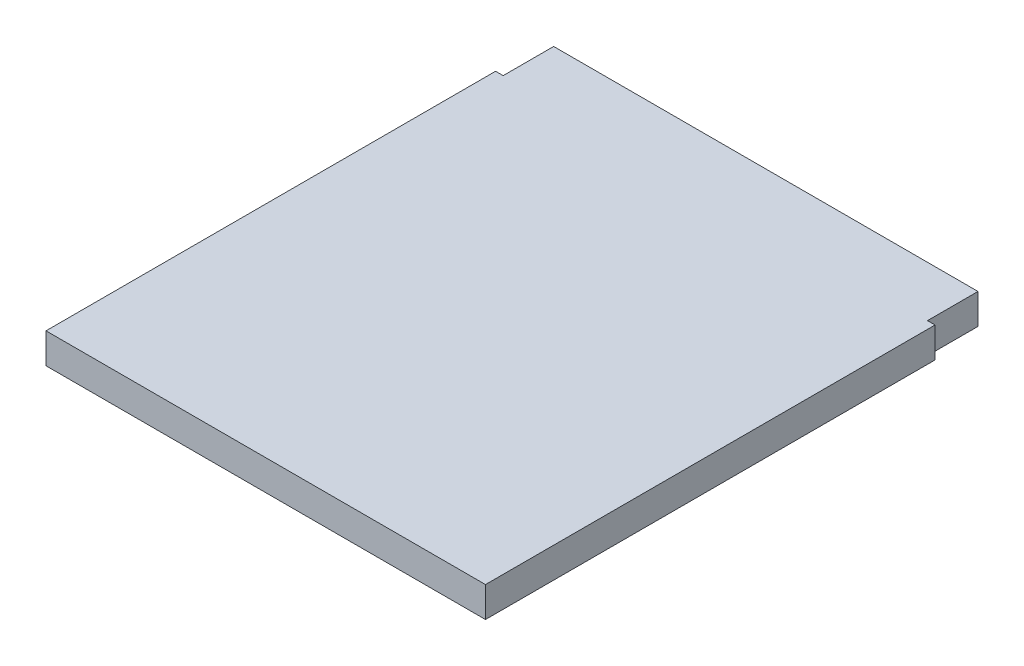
ISO-10303-21;
HEADER;
FILE_DESCRIPTION(('STEP AP214'),'2;1');
FILE_NAME('part.step','',(''),(''),'','','');
FILE_SCHEMA(('AUTOMOTIVE_DESIGN { 1 0 10303 214 1 1 1 1 }'));
ENDSEC;
DATA;
#1=APPLICATION_CONTEXT('core data for automotive mechanical design processes');
#2=APPLICATION_PROTOCOL_DEFINITION('international standard','automotive_design',2000,#1);
#3=PRODUCT_CONTEXT('',#1,'mechanical');
#4=PRODUCT('Part','Part','',(#3));
#5=PRODUCT_RELATED_PRODUCT_CATEGORY('part','',(#4));
#6=PRODUCT_DEFINITION_FORMATION('','',#4);
#7=PRODUCT_DEFINITION_CONTEXT('part definition',#1,'design');
#8=PRODUCT_DEFINITION('design','',#6,#7);
#9=PRODUCT_DEFINITION_SHAPE('','',#8);
#10=(LENGTH_UNIT() NAMED_UNIT(*) SI_UNIT(.MILLI.,.METRE.));
#11=(NAMED_UNIT(*) PLANE_ANGLE_UNIT() SI_UNIT($,.RADIAN.));
#12=(NAMED_UNIT(*) SI_UNIT($,.STERADIAN.) SOLID_ANGLE_UNIT());
#13=UNCERTAINTY_MEASURE_WITH_UNIT(LENGTH_MEASURE(1.E-05),#10,'distance_accuracy_value','');
#14=(GEOMETRIC_REPRESENTATION_CONTEXT(3) GLOBAL_UNCERTAINTY_ASSIGNED_CONTEXT((#13)) GLOBAL_UNIT_ASSIGNED_CONTEXT((#10,
#11,#12)) REPRESENTATION_CONTEXT('',''));
#15=CARTESIAN_POINT('',(0.,0.,0.));
#16=DIRECTION('',(0.,0.,1.));
#17=DIRECTION('',(1.,0.,0.));
#18=AXIS2_PLACEMENT_3D('',#15,#16,#17);
#19=CARTESIAN_POINT('',(0.,0.,93.));
#20=DIRECTION('',(0.,0.,1.));
#21=DIRECTION('',(1.,0.,0.));
#22=AXIS2_PLACEMENT_3D('',#19,#20,#21);
#23=PLANE('',#22);
#24=DIRECTION('',(1.,0.,0.));
#25=VECTOR('',#24,1.);
#26=CARTESIAN_POINT('',(60.,65.,93.));
#27=LINE('',#26,#25);
#28=CARTESIAN_POINT('',(57.,65.,93.));
#29=VERTEX_POINT('',#28);
#30=CARTESIAN_POINT('',(231.,65.,93.));
#31=VERTEX_POINT('',#30);
#32=EDGE_CURVE('E113',#29,#31,#27,.T.);
#33=ORIENTED_EDGE('',*,*,#32,.F.);
#34=DIRECTION('',(0.,1.,0.));
#35=VECTOR('',#34,1.);
#36=CARTESIAN_POINT('',(57.,53.,93.));
#37=LINE('',#36,#35);
#38=CARTESIAN_POINT('',(57.,53.,93.));
#39=VERTEX_POINT('',#38);
#40=EDGE_CURVE('E116',#39,#29,#37,.T.);
#41=ORIENTED_EDGE('',*,*,#40,.F.);
#42=DIRECTION('',(-1.,0.,0.));
#43=VECTOR('',#42,1.);
#44=CARTESIAN_POINT('',(60.,53.,93.));
#45=LINE('',#44,#43);
#46=CARTESIAN_POINT('',(231.,53.,93.));
#47=VERTEX_POINT('',#46);
#48=EDGE_CURVE('E100',#47,#39,#45,.T.);
#49=ORIENTED_EDGE('',*,*,#48,.F.);
#50=DIRECTION('',(0.,1.,0.));
#51=VECTOR('',#50,1.);
#52=CARTESIAN_POINT('',(231.,53.,93.));
#53=LINE('',#52,#51);
#54=EDGE_CURVE('E120',#47,#31,#53,.T.);
#55=ORIENTED_EDGE('',*,*,#54,.T.);
#56=EDGE_LOOP('',(#33,#41,#49,#55));
#57=FACE_BOUND('',#56,.T.);
#58=ADVANCED_FACE('F35',(#57),#23,.T.);
#59=CARTESIAN_POINT('',(60.,53.,-273.428026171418));
#60=DIRECTION('',(0.,1.,0.));
#61=DIRECTION('',(-1.,0.,0.));
#62=AXIS2_PLACEMENT_3D('',#59,#60,#61);
#63=PLANE('',#62);
#64=DIRECTION('',(0.,0.,1.));
#65=VECTOR('',#64,1.);
#66=CARTESIAN_POINT('',(228.,53.,-273.428026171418));
#67=LINE('',#66,#65);
#68=CARTESIAN_POINT('',(228.,53.,-105.));
#69=VERTEX_POINT('',#68);
#70=CARTESIAN_POINT('',(228.,53.,-85.));
#71=VERTEX_POINT('',#70);
#72=EDGE_CURVE('E158',#69,#71,#67,.T.);
#73=ORIENTED_EDGE('',*,*,#72,.T.);
#74=DIRECTION('',(-1.,0.,0.));
#75=VECTOR('',#74,1.);
#76=CARTESIAN_POINT('',(57.,53.,-85.));
#77=LINE('',#76,#75);
#78=CARTESIAN_POINT('',(231.,53.,-85.));
#79=VERTEX_POINT('',#78);
#80=EDGE_CURVE('E121',#79,#71,#77,.T.);
#81=ORIENTED_EDGE('',*,*,#80,.F.);
#82=DIRECTION('',(0.,0.,-1.));
#83=VECTOR('',#82,1.);
#84=CARTESIAN_POINT('',(231.,53.,93.));
#85=LINE('',#84,#83);
#86=EDGE_CURVE('E108',#47,#79,#85,.T.);
#87=ORIENTED_EDGE('',*,*,#86,.F.);
#88=ORIENTED_EDGE('',*,*,#48,.T.);
#89=DIRECTION('',(0.,0.,1.));
#90=VECTOR('',#89,1.);
#91=CARTESIAN_POINT('',(57.,53.,93.));
#92=LINE('',#91,#90);
#93=CARTESIAN_POINT('',(57.,53.,-85.));
#94=VERTEX_POINT('',#93);
#95=EDGE_CURVE('E105',#94,#39,#92,.T.);
#96=ORIENTED_EDGE('',*,*,#95,.F.);
#97=CARTESIAN_POINT('',(60.,53.,-85.));
#98=VERTEX_POINT('',#97);
#99=EDGE_CURVE('E129',#98,#94,#77,.T.);
#100=ORIENTED_EDGE('',*,*,#99,.F.);
#101=DIRECTION('',(0.,0.,1.));
#102=VECTOR('',#101,1.);
#103=CARTESIAN_POINT('',(60.,53.,-273.428026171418));
#104=LINE('',#103,#102);
#105=CARTESIAN_POINT('',(60.,53.,-105.));
#106=VERTEX_POINT('',#105);
#107=EDGE_CURVE('E112',#106,#98,#104,.T.);
#108=ORIENTED_EDGE('',*,*,#107,.F.);
#109=DIRECTION('',(1.,0.,0.));
#110=VECTOR('',#109,1.);
#111=CARTESIAN_POINT('',(60.,53.,-105.));
#112=LINE('',#111,#110);
#113=EDGE_CURVE('E150',#106,#69,#112,.T.);
#114=ORIENTED_EDGE('',*,*,#113,.T.);
#115=EDGE_LOOP('',(#73,#81,#87,#88,#96,#100,#108,#114));
#116=FACE_BOUND('',#115,.T.);
#117=ADVANCED_FACE('F102',(#116),#63,.F.);
#118=CARTESIAN_POINT('',(228.,65.,-273.428026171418));
#119=DIRECTION('',(-1.,0.,0.));
#120=DIRECTION('',(0.,0.,1.));
#121=AXIS2_PLACEMENT_3D('',#118,#119,#120);
#122=PLANE('',#121);
#123=DIRECTION('',(0.,0.,1.));
#124=VECTOR('',#123,1.);
#125=CARTESIAN_POINT('',(228.,65.,-273.428026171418));
#126=LINE('',#125,#124);
#127=CARTESIAN_POINT('',(228.,65.,-105.));
#128=VERTEX_POINT('',#127);
#129=CARTESIAN_POINT('',(228.,65.,-85.));
#130=VERTEX_POINT('',#129);
#131=EDGE_CURVE('E55',#128,#130,#126,.T.);
#132=ORIENTED_EDGE('',*,*,#131,.T.);
#133=DIRECTION('',(0.,-1.,0.));
#134=VECTOR('',#133,1.);
#135=CARTESIAN_POINT('',(228.,65.,-85.));
#136=LINE('',#135,#134);
#137=EDGE_CURVE('E50',#130,#71,#136,.T.);
#138=ORIENTED_EDGE('',*,*,#137,.T.);
#139=ORIENTED_EDGE('',*,*,#72,.F.);
#140=DIRECTION('',(0.,1.,0.));
#141=VECTOR('',#140,1.);
#142=CARTESIAN_POINT('',(228.,65.,-105.));
#143=LINE('',#142,#141);
#144=EDGE_CURVE('E147',#69,#128,#143,.T.);
#145=ORIENTED_EDGE('',*,*,#144,.T.);
#146=EDGE_LOOP('',(#132,#138,#139,#145));
#147=FACE_BOUND('',#146,.T.);
#148=ADVANCED_FACE('F172',(#147),#122,.F.);
#149=CARTESIAN_POINT('',(60.,65.,-273.428026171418));
#150=DIRECTION('',(0.,-1.,0.));
#151=DIRECTION('',(1.,0.,0.));
#152=AXIS2_PLACEMENT_3D('',#149,#150,#151);
#153=PLANE('',#152);
#154=DIRECTION('',(0.,0.,1.));
#155=VECTOR('',#154,1.);
#156=CARTESIAN_POINT('',(60.,65.,-273.428026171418));
#157=LINE('',#156,#155);
#158=CARTESIAN_POINT('',(60.,65.,-105.));
#159=VERTEX_POINT('',#158);
#160=CARTESIAN_POINT('',(60.,65.,-85.));
#161=VERTEX_POINT('',#160);
#162=EDGE_CURVE('E161',#159,#161,#157,.T.);
#163=ORIENTED_EDGE('',*,*,#162,.T.);
#164=DIRECTION('',(-1.,0.,0.));
#165=VECTOR('',#164,1.);
#166=CARTESIAN_POINT('',(57.,65.,-85.));
#167=LINE('',#166,#165);
#168=CARTESIAN_POINT('',(57.,65.,-85.));
#169=VERTEX_POINT('',#168);
#170=EDGE_CURVE('E132',#161,#169,#167,.T.);
#171=ORIENTED_EDGE('',*,*,#170,.T.);
#172=DIRECTION('',(0.,0.,1.));
#173=VECTOR('',#172,1.);
#174=CARTESIAN_POINT('',(57.,65.,93.));
#175=LINE('',#174,#173);
#176=EDGE_CURVE('E137',#169,#29,#175,.T.);
#177=ORIENTED_EDGE('',*,*,#176,.T.);
#178=ORIENTED_EDGE('',*,*,#32,.T.);
#179=DIRECTION('',(0.,0.,-1.));
#180=VECTOR('',#179,1.);
#181=CARTESIAN_POINT('',(231.,65.,93.));
#182=LINE('',#181,#180);
#183=CARTESIAN_POINT('',(231.,65.,-85.));
#184=VERTEX_POINT('',#183);
#185=EDGE_CURVE('E139',#31,#184,#182,.T.);
#186=ORIENTED_EDGE('',*,*,#185,.T.);
#187=EDGE_CURVE('E127',#184,#130,#167,.T.);
#188=ORIENTED_EDGE('',*,*,#187,.T.);
#189=ORIENTED_EDGE('',*,*,#131,.F.);
#190=DIRECTION('',(-1.,0.,0.));
#191=VECTOR('',#190,1.);
#192=CARTESIAN_POINT('',(60.,65.,-105.));
#193=LINE('',#192,#191);
#194=EDGE_CURVE('E149',#128,#159,#193,.T.);
#195=ORIENTED_EDGE('',*,*,#194,.T.);
#196=EDGE_LOOP('',(#163,#171,#177,#178,#186,#188,#189,#195));
#197=FACE_BOUND('',#196,.T.);
#198=ADVANCED_FACE('F170',(#197),#153,.F.);
#199=CARTESIAN_POINT('',(60.,65.,-273.428026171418));
#200=DIRECTION('',(1.,0.,0.));
#201=DIRECTION('',(0.,0.,-1.));
#202=AXIS2_PLACEMENT_3D('',#199,#200,#201);
#203=PLANE('',#202);
#204=ORIENTED_EDGE('',*,*,#107,.T.);
#205=DIRECTION('',(0.,1.,0.));
#206=VECTOR('',#205,1.);
#207=CARTESIAN_POINT('',(60.,65.,-85.));
#208=LINE('',#207,#206);
#209=EDGE_CURVE('E11',#98,#161,#208,.T.);
#210=ORIENTED_EDGE('',*,*,#209,.T.);
#211=ORIENTED_EDGE('',*,*,#162,.F.);
#212=DIRECTION('',(0.,-1.,0.));
#213=VECTOR('',#212,1.);
#214=CARTESIAN_POINT('',(60.,65.,-105.));
#215=LINE('',#214,#213);
#216=EDGE_CURVE('E43',#159,#106,#215,.T.);
#217=ORIENTED_EDGE('',*,*,#216,.T.);
#218=EDGE_LOOP('',(#204,#210,#211,#217));
#219=FACE_BOUND('',#218,.T.);
#220=ADVANCED_FACE('F37',(#219),#203,.F.);
#221=CARTESIAN_POINT('',(0.,0.,-105.));
#222=DIRECTION('',(0.,0.,1.));
#223=DIRECTION('',(1.,0.,0.));
#224=AXIS2_PLACEMENT_3D('',#221,#222,#223);
#225=PLANE('',#224);
#226=ORIENTED_EDGE('',*,*,#194,.F.);
#227=ORIENTED_EDGE('',*,*,#144,.F.);
#228=ORIENTED_EDGE('',*,*,#113,.F.);
#229=ORIENTED_EDGE('',*,*,#216,.F.);
#230=EDGE_LOOP('',(#226,#227,#228,#229));
#231=FACE_BOUND('',#230,.T.);
#232=ADVANCED_FACE('F166',(#231),#225,.F.);
#233=CARTESIAN_POINT('',(57.,53.,93.));
#234=DIRECTION('',(-1.,0.,0.));
#235=DIRECTION('',(0.,-1.,0.));
#236=AXIS2_PLACEMENT_3D('',#233,#234,#235);
#237=PLANE('',#236);
#238=ORIENTED_EDGE('',*,*,#176,.F.);
#239=DIRECTION('',(0.,1.,0.));
#240=VECTOR('',#239,1.);
#241=CARTESIAN_POINT('',(57.,53.,-85.));
#242=LINE('',#241,#240);
#243=EDGE_CURVE('E126',#94,#169,#242,.T.);
#244=ORIENTED_EDGE('',*,*,#243,.F.);
#245=ORIENTED_EDGE('',*,*,#95,.T.);
#246=ORIENTED_EDGE('',*,*,#40,.T.);
#247=EDGE_LOOP('',(#238,#244,#245,#246));
#248=FACE_BOUND('',#247,.T.);
#249=ADVANCED_FACE('F124',(#248),#237,.T.);
#250=CARTESIAN_POINT('',(57.,53.,-85.));
#251=DIRECTION('',(0.,0.,-1.));
#252=DIRECTION('',(-1.,0.,0.));
#253=AXIS2_PLACEMENT_3D('',#250,#251,#252);
#254=PLANE('',#253);
#255=ORIENTED_EDGE('',*,*,#209,.F.);
#256=ORIENTED_EDGE('',*,*,#99,.T.);
#257=ORIENTED_EDGE('',*,*,#243,.T.);
#258=ORIENTED_EDGE('',*,*,#170,.F.);
#259=EDGE_LOOP('',(#255,#256,#257,#258));
#260=FACE_BOUND('',#259,.T.);
#261=ADVANCED_FACE('F189',(#260),#254,.T.);
#262=ORIENTED_EDGE('',*,*,#137,.F.);
#263=ORIENTED_EDGE('',*,*,#187,.F.);
#264=DIRECTION('',(0.,1.,0.));
#265=VECTOR('',#264,1.);
#266=CARTESIAN_POINT('',(231.,53.,-85.));
#267=LINE('',#266,#265);
#268=EDGE_CURVE('E143',#79,#184,#267,.T.);
#269=ORIENTED_EDGE('',*,*,#268,.F.);
#270=ORIENTED_EDGE('',*,*,#80,.T.);
#271=EDGE_LOOP('',(#262,#263,#269,#270));
#272=FACE_BOUND('',#271,.T.);
#273=ADVANCED_FACE('F193',(#272),#254,.T.);
#274=CARTESIAN_POINT('',(231.,53.,93.));
#275=DIRECTION('',(1.,0.,0.));
#276=DIRECTION('',(0.,1.,0.));
#277=AXIS2_PLACEMENT_3D('',#274,#275,#276);
#278=PLANE('',#277);
#279=ORIENTED_EDGE('',*,*,#185,.F.);
#280=ORIENTED_EDGE('',*,*,#54,.F.);
#281=ORIENTED_EDGE('',*,*,#86,.T.);
#282=ORIENTED_EDGE('',*,*,#268,.T.);
#283=EDGE_LOOP('',(#279,#280,#281,#282));
#284=FACE_BOUND('',#283,.T.);
#285=ADVANCED_FACE('F190',(#284),#278,.T.);
#286=CLOSED_SHELL('',(#58,#117,#148,#198,#220,#232,#249,#261,#273,#285));
#287=MANIFOLD_SOLID_BREP('B2',#286);
#288=ADVANCED_BREP_SHAPE_REPRESENTATION('',(#18,#287),#14);
#289=SHAPE_DEFINITION_REPRESENTATION(#9,#288);
ENDSEC;
END-ISO-10303-21;
